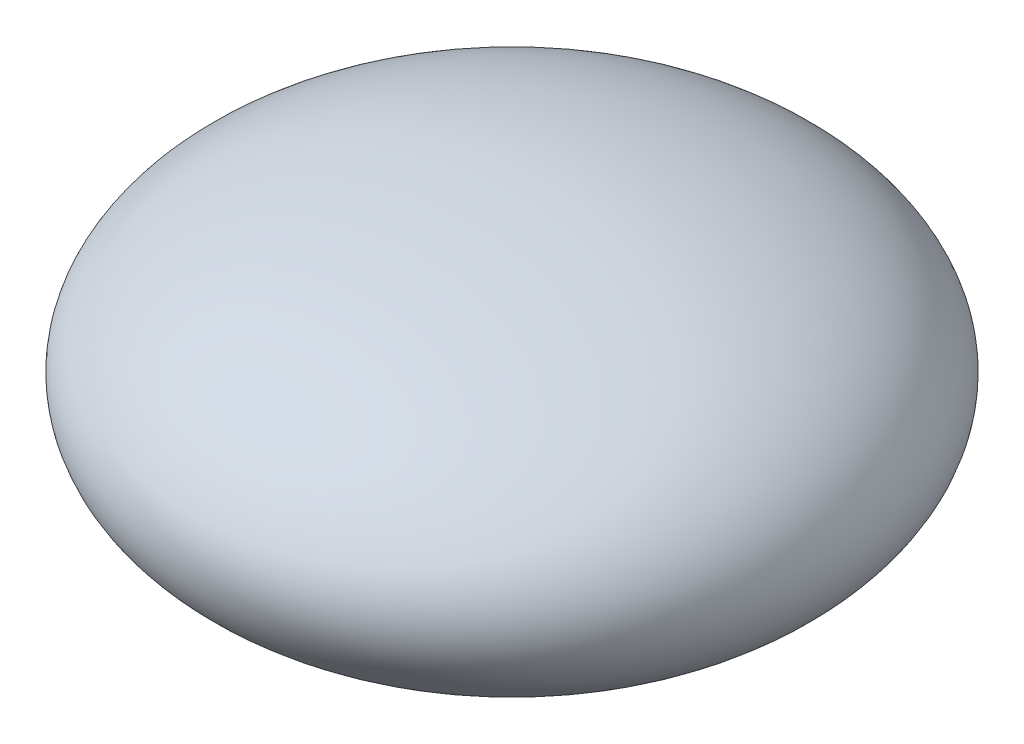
from build123d import *


with BuildPart() as part:
    # Sketch1 → Revolve1 (revolve)
    with BuildSketch(Plane.XY):
        with BuildLine():
            Line((0, 38.1), (0, -38.1))
            add(Edge.make_bspline(
                [(0, 38.1), (-79.375, 38.1), (-79.375, 0), (-79.375, -38.1), (0, -38.1)],
                knots=[4.71238898, 4.71238898, 4.71238898, 6.283185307, 6.283185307, 7.853981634, 7.853981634, 7.853981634], degree=2, weights=[1, 0.707106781, 1, 0.707106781, 1]))
        make_face()
    revolve(axis=Axis((0, 38.1, 0), (0, -1, 0)))


solid = part.part
